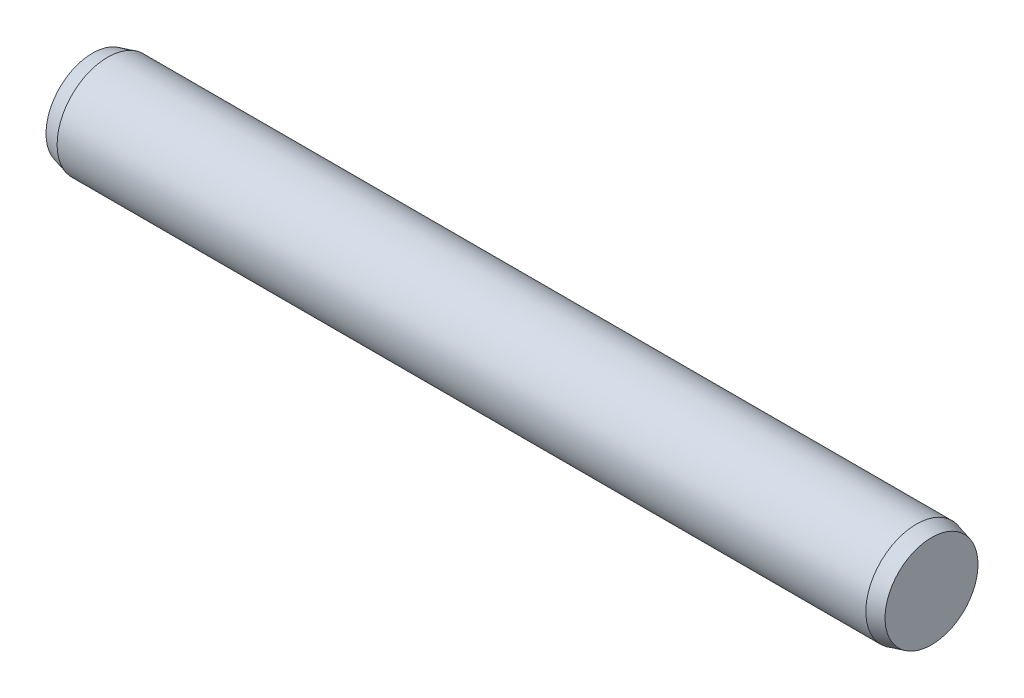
ISO-10303-21;
HEADER;
FILE_DESCRIPTION(('STEP AP214'),'2;1');
FILE_NAME('part.step','',(''),(''),'','','');
FILE_SCHEMA(('AUTOMOTIVE_DESIGN { 1 0 10303 214 1 1 1 1 }'));
ENDSEC;
DATA;
#1=APPLICATION_CONTEXT('core data for automotive mechanical design processes');
#2=APPLICATION_PROTOCOL_DEFINITION('international standard','automotive_design',2000,#1);
#3=PRODUCT_CONTEXT('',#1,'mechanical');
#4=PRODUCT('Part','Part','',(#3));
#5=PRODUCT_RELATED_PRODUCT_CATEGORY('part','',(#4));
#6=PRODUCT_DEFINITION_FORMATION('','',#4);
#7=PRODUCT_DEFINITION_CONTEXT('part definition',#1,'design');
#8=PRODUCT_DEFINITION('design','',#6,#7);
#9=PRODUCT_DEFINITION_SHAPE('','',#8);
#10=(LENGTH_UNIT() NAMED_UNIT(*) SI_UNIT(.MILLI.,.METRE.));
#11=(NAMED_UNIT(*) PLANE_ANGLE_UNIT() SI_UNIT($,.RADIAN.));
#12=(NAMED_UNIT(*) SI_UNIT($,.STERADIAN.) SOLID_ANGLE_UNIT());
#13=UNCERTAINTY_MEASURE_WITH_UNIT(LENGTH_MEASURE(1.E-05),#10,'distance_accuracy_value','');
#14=(GEOMETRIC_REPRESENTATION_CONTEXT(3) GLOBAL_UNCERTAINTY_ASSIGNED_CONTEXT((#13)) GLOBAL_UNIT_ASSIGNED_CONTEXT((#10,
#11,#12)) REPRESENTATION_CONTEXT('',''));
#15=CARTESIAN_POINT('',(0.,0.,0.));
#16=DIRECTION('',(0.,0.,1.));
#17=DIRECTION('',(1.,0.,0.));
#18=AXIS2_PLACEMENT_3D('',#15,#16,#17);
#19=CARTESIAN_POINT('',(-4.,0.,0.));
#20=DIRECTION('',(1.,0.,0.));
#21=DIRECTION('',(0.,0.,-1.));
#22=AXIS2_PLACEMENT_3D('',#19,#20,#21);
#23=CYLINDRICAL_SURFACE('',#22,0.500000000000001);
#24=CARTESIAN_POINT('',(-4.,0.,0.));
#25=DIRECTION('',(-1.,0.,0.));
#26=DIRECTION('',(0.,0.,1.));
#27=AXIS2_PLACEMENT_3D('',#24,#25,#26);
#28=CIRCLE('',#27,0.500000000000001);
#29=CARTESIAN_POINT('',(-4.,0.,0.500000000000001));
#30=VERTEX_POINT('',#29);
#31=EDGE_CURVE('E47',#30,#30,#28,.T.);
#32=ORIENTED_EDGE('',*,*,#31,.F.);
#33=EDGE_LOOP('',(#32));
#34=FACE_BOUND('',#33,.T.);
#35=CARTESIAN_POINT('',(4.,0.,0.));
#36=DIRECTION('',(1.,0.,0.));
#37=DIRECTION('',(0.,0.,-1.));
#38=AXIS2_PLACEMENT_3D('',#35,#36,#37);
#39=CIRCLE('',#38,0.500000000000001);
#40=CARTESIAN_POINT('',(4.,0.,-0.500000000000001));
#41=VERTEX_POINT('',#40);
#42=EDGE_CURVE('E10',#41,#41,#39,.T.);
#43=ORIENTED_EDGE('',*,*,#42,.F.);
#44=EDGE_LOOP('',(#43));
#45=FACE_BOUND('',#44,.T.);
#46=ADVANCED_FACE('F33',(#34,#45),#23,.T.);
#47=CARTESIAN_POINT('',(4.,0.,0.));
#48=DIRECTION('',(-1.,0.,0.));
#49=DIRECTION('',(0.,0.,-1.));
#50=AXIS2_PLACEMENT_3D('',#47,#48,#49);
#51=CONICAL_SURFACE('',#50,0.500000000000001,0.26179938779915);
#52=CARTESIAN_POINT('',(4.15,0.,0.));
#53=DIRECTION('',(1.,0.,0.));
#54=DIRECTION('',(0.,0.,-1.));
#55=AXIS2_PLACEMENT_3D('',#52,#53,#54);
#56=CIRCLE('',#55,0.459807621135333);
#57=CARTESIAN_POINT('',(4.15,0.,-0.459807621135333));
#58=VERTEX_POINT('',#57);
#59=EDGE_CURVE('E39',#58,#58,#56,.T.);
#60=ORIENTED_EDGE('',*,*,#59,.F.);
#61=EDGE_LOOP('',(#60));
#62=FACE_BOUND('',#61,.T.);
#63=ORIENTED_EDGE('',*,*,#42,.T.);
#64=EDGE_LOOP('',(#63));
#65=FACE_BOUND('',#64,.T.);
#66=ADVANCED_FACE('F57',(#62,#65),#51,.T.);
#67=CARTESIAN_POINT('',(4.15,0.,0.));
#68=DIRECTION('',(1.,0.,0.));
#69=DIRECTION('',(0.,0.,-1.));
#70=AXIS2_PLACEMENT_3D('',#67,#68,#69);
#71=PLANE('',#70);
#72=ORIENTED_EDGE('',*,*,#59,.T.);
#73=EDGE_LOOP('',(#72));
#74=FACE_BOUND('',#73,.T.);
#75=ADVANCED_FACE('F61',(#74),#71,.T.);
#76=CARTESIAN_POINT('',(-4.,0.,0.));
#77=DIRECTION('',(1.,0.,0.));
#78=DIRECTION('',(0.,0.,1.));
#79=AXIS2_PLACEMENT_3D('',#76,#77,#78);
#80=CONICAL_SURFACE('',#79,0.500000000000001,0.26179938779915);
#81=CARTESIAN_POINT('',(-4.15,0.,0.));
#82=DIRECTION('',(-1.,0.,0.));
#83=DIRECTION('',(0.,0.,1.));
#84=AXIS2_PLACEMENT_3D('',#81,#82,#83);
#85=CIRCLE('',#84,0.459807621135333);
#86=CARTESIAN_POINT('',(-4.15,0.,0.459807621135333));
#87=VERTEX_POINT('',#86);
#88=EDGE_CURVE('E43',#87,#87,#85,.T.);
#89=ORIENTED_EDGE('',*,*,#88,.F.);
#90=EDGE_LOOP('',(#89));
#91=FACE_BOUND('',#90,.T.);
#92=ORIENTED_EDGE('',*,*,#31,.T.);
#93=EDGE_LOOP('',(#92));
#94=FACE_BOUND('',#93,.T.);
#95=ADVANCED_FACE('F53',(#91,#94),#80,.T.);
#96=CARTESIAN_POINT('',(-4.15,0.,0.));
#97=DIRECTION('',(-1.,0.,0.));
#98=DIRECTION('',(0.,0.,1.));
#99=AXIS2_PLACEMENT_3D('',#96,#97,#98);
#100=PLANE('',#99);
#101=ORIENTED_EDGE('',*,*,#88,.T.);
#102=EDGE_LOOP('',(#101));
#103=FACE_BOUND('',#102,.T.);
#104=ADVANCED_FACE('F70',(#103),#100,.T.);
#105=CLOSED_SHELL('',(#46,#66,#75,#95,#104));
#106=MANIFOLD_SOLID_BREP('B2',#105);
#107=ADVANCED_BREP_SHAPE_REPRESENTATION('',(#18,#106),#14);
#108=SHAPE_DEFINITION_REPRESENTATION(#9,#107);
ENDSEC;
END-ISO-10303-21;
